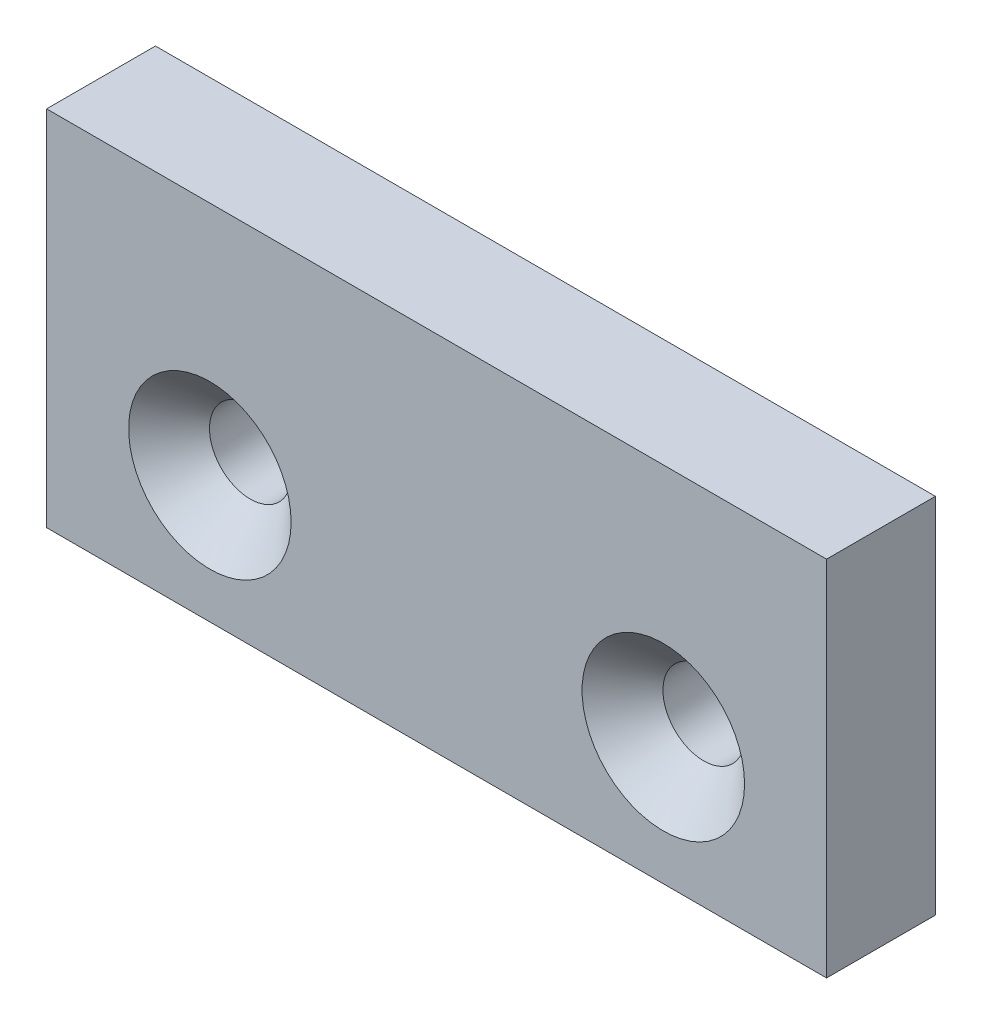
from build123d import *

# Parameters (mm, degrees)
ESQUISSE1_W                                      = 43
ESQUISSE1_H                                      = 20
EXTRUSION1_DEPTH                                 = 6
FRAISAGE_POUR_VIS_T_TE_FRAIS_E_6_PAN_D           = 4.5
FRAISAGE_POUR_VIS_T_TE_FRAIS_E_6_PAN_CSINK_D     = 8.96
FRAISAGE_POUR_VIS_T_TE_FRAIS_E_6_PAN_CSINK_ANGLE = 90


with BuildPart() as part:
    # Esquisse1 → Extrusion1 (new body)
    with BuildSketch(Plane.XY):
        with Locations((21.5, -10)):
            Rectangle(ESQUISSE1_W, ESQUISSE1_H)
    extrude(amount=EXTRUSION1_DEPTH)

    # Fraisage pour vis _ t_te frais_e _ 6 pan (through all)
    with Locations(Plane.XY.offset(6)):
        with Locations((9, -13), (34, -13)):
            CounterSinkHole(FRAISAGE_POUR_VIS_T_TE_FRAIS_E_6_PAN_D / 2, FRAISAGE_POUR_VIS_T_TE_FRAIS_E_6_PAN_CSINK_D / 2, counter_sink_angle=FRAISAGE_POUR_VIS_T_TE_FRAIS_E_6_PAN_CSINK_ANGLE)


solid = part.part
